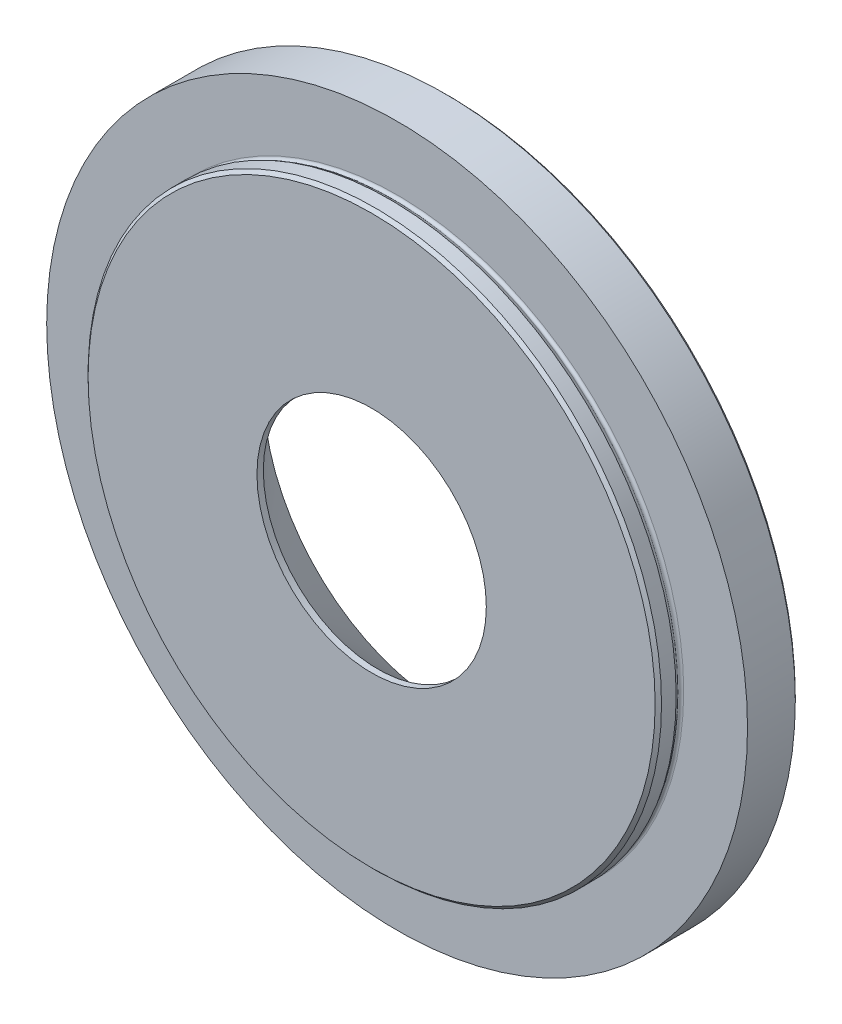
from build123d import *


with BuildPart() as part:
    # Sketch1 → Revolve1 (revolve)
    with BuildSketch(Plane(origin=(0, -18, -1.35), x_dir=(0, 0, -1), z_dir=(1, 0, 0)), mode=Mode.PRIVATE) as revolve1_sk:
        Polygon((-5.35, 36), (-4.35, 36), (6.65, 47), (6.65, 63), (-4.85, 63), (-5.35, 62.5), align=None)
    revolve(revolve1_sk.sketch.rotate(Axis((0, 0, 4), (0, 0, -1)), 90), axis=Axis((0, 0, 4), (0, 0, -1)))

    # Sketch2 → Revolve2 (revolve)
    with BuildSketch(Plane(origin=(0, 0, 0), x_dir=(0, 0, -1), z_dir=(1, 0, 0)), mode=Mode.PRIVATE) as revolve2_sk:
        Polygon((7.5, 55), (8, 54.5), (8, 45), (0, 45), (0, 55), align=None)
    revolve(revolve2_sk.sketch.rotate(Axis((0, 0, 4), (0, 0, -1)), 90), axis=Axis((0, 0, 4), (0, 0, -1)))

    # Sketch3 → Cut-Revolve1 (revolve, cut)
    with BuildSketch(Plane(origin=(0, 0, 0), x_dir=(0, 0, -1), z_dir=(1, 0, 0)), mode=Mode.PRIVATE) as cut_revolve1_sk:
        with BuildLine():
            Line((-1.2, 45), (0, 45))
            Line((0, 45), (0, 44.985964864))
            ThreePointArc((0, 44.985964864), (-0.203030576, 44.637822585), (-0.60601523, 44.643097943))
            Line((-0.60601523, 44.643097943), (-1.2, 45))
        make_face()
    revolve(cut_revolve1_sk.sketch.rotate(Axis((0, 0, 4), (0, 0, -1)), 90), axis=Axis((0, 0, 4), (0, 0, -1)), mode=Mode.SUBTRACT)


solid = part.part
